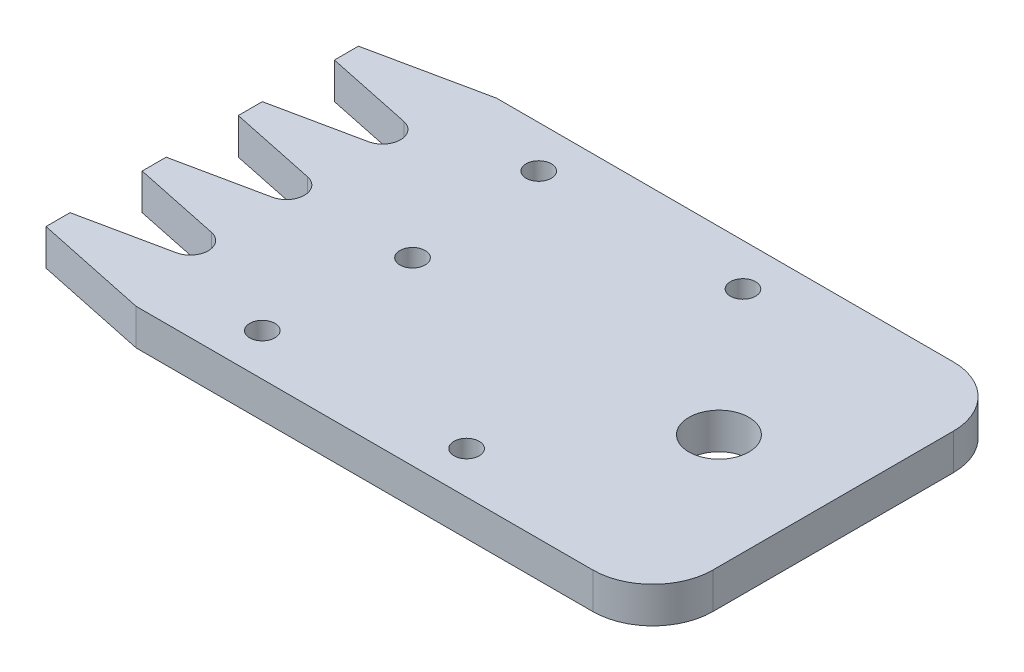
ISO-10303-21;
HEADER;
FILE_DESCRIPTION(('STEP AP214'),'2;1');
FILE_NAME('part.step','',(''),(''),'','','');
FILE_SCHEMA(('AUTOMOTIVE_DESIGN { 1 0 10303 214 1 1 1 1 }'));
ENDSEC;
DATA;
#1=APPLICATION_CONTEXT('core data for automotive mechanical design processes');
#2=APPLICATION_PROTOCOL_DEFINITION('international standard','automotive_design',2000,#1);
#3=PRODUCT_CONTEXT('',#1,'mechanical');
#4=PRODUCT('Part','Part','',(#3));
#5=PRODUCT_RELATED_PRODUCT_CATEGORY('part','',(#4));
#6=PRODUCT_DEFINITION_FORMATION('','',#4);
#7=PRODUCT_DEFINITION_CONTEXT('part definition',#1,'design');
#8=PRODUCT_DEFINITION('design','',#6,#7);
#9=PRODUCT_DEFINITION_SHAPE('','',#8);
#10=(LENGTH_UNIT() NAMED_UNIT(*) SI_UNIT(.MILLI.,.METRE.));
#11=(NAMED_UNIT(*) PLANE_ANGLE_UNIT() SI_UNIT($,.RADIAN.));
#12=(NAMED_UNIT(*) SI_UNIT($,.STERADIAN.) SOLID_ANGLE_UNIT());
#13=UNCERTAINTY_MEASURE_WITH_UNIT(LENGTH_MEASURE(1.E-05),#10,'distance_accuracy_value','');
#14=(GEOMETRIC_REPRESENTATION_CONTEXT(3) GLOBAL_UNCERTAINTY_ASSIGNED_CONTEXT((#13)) GLOBAL_UNIT_ASSIGNED_CONTEXT((#10,
#11,#12)) REPRESENTATION_CONTEXT('',''));
#15=CARTESIAN_POINT('',(0.,0.,0.));
#16=DIRECTION('',(0.,0.,1.));
#17=DIRECTION('',(1.,0.,0.));
#18=AXIS2_PLACEMENT_3D('',#15,#16,#17);
#19=CARTESIAN_POINT('',(14.,6.,-46.));
#20=DIRECTION('',(0.,1.,0.));
#21=DIRECTION('',(0.,0.,1.));
#22=AXIS2_PLACEMENT_3D('',#19,#20,#21);
#23=PLANE('',#22);
#24=CARTESIAN_POINT('',(33.,6.,-53.));
#25=DIRECTION('',(0.,1.,0.));
#26=DIRECTION('',(0.,0.,1.));
#27=AXIS2_PLACEMENT_3D('',#24,#25,#26);
#28=CIRCLE('',#27,2.1);
#29=CARTESIAN_POINT('',(33.,6.,-50.9));
#30=VERTEX_POINT('',#29);
#31=EDGE_CURVE('E395',#30,#30,#28,.T.);
#32=ORIENTED_EDGE('',*,*,#31,.F.);
#33=EDGE_LOOP('',(#32));
#34=FACE_BOUND('',#33,.T.);
#35=CARTESIAN_POINT('',(35.,6.,-30.));
#36=DIRECTION('',(0.,1.,0.));
#37=DIRECTION('',(0.,0.,1.));
#38=AXIS2_PLACEMENT_3D('',#35,#36,#37);
#39=CIRCLE('',#38,2.1);
#40=CARTESIAN_POINT('',(35.,6.,-27.9));
#41=VERTEX_POINT('',#40);
#42=EDGE_CURVE('E397',#41,#41,#39,.T.);
#43=ORIENTED_EDGE('',*,*,#42,.F.);
#44=EDGE_LOOP('',(#43));
#45=FACE_BOUND('',#44,.T.);
#46=CARTESIAN_POINT('',(33.,6.,-7.));
#47=DIRECTION('',(0.,1.,0.));
#48=DIRECTION('',(0.,0.,1.));
#49=AXIS2_PLACEMENT_3D('',#46,#47,#48);
#50=CIRCLE('',#49,2.1);
#51=CARTESIAN_POINT('',(33.,6.,-4.9));
#52=VERTEX_POINT('',#51);
#53=EDGE_CURVE('E405',#52,#52,#50,.T.);
#54=ORIENTED_EDGE('',*,*,#53,.F.);
#55=EDGE_LOOP('',(#54));
#56=FACE_BOUND('',#55,.T.);
#57=CARTESIAN_POINT('',(67.,6.,-7.));
#58=DIRECTION('',(0.,1.,0.));
#59=DIRECTION('',(0.,0.,1.));
#60=AXIS2_PLACEMENT_3D('',#57,#58,#59);
#61=CIRCLE('',#60,2.1);
#62=CARTESIAN_POINT('',(67.,6.,-4.9));
#63=VERTEX_POINT('',#62);
#64=EDGE_CURVE('E411',#63,#63,#61,.T.);
#65=ORIENTED_EDGE('',*,*,#64,.F.);
#66=EDGE_LOOP('',(#65));
#67=FACE_BOUND('',#66,.T.);
#68=CARTESIAN_POINT('',(67.,6.,-53.));
#69=DIRECTION('',(0.,1.,0.));
#70=DIRECTION('',(0.,0.,1.));
#71=AXIS2_PLACEMENT_3D('',#68,#69,#70);
#72=CIRCLE('',#71,2.1);
#73=CARTESIAN_POINT('',(67.,6.,-50.9));
#74=VERTEX_POINT('',#73);
#75=EDGE_CURVE('E417',#74,#74,#72,.T.);
#76=ORIENTED_EDGE('',*,*,#75,.F.);
#77=EDGE_LOOP('',(#76));
#78=FACE_BOUND('',#77,.T.);
#79=CARTESIAN_POINT('',(14.,6.,-46.));
#80=DIRECTION('',(0.,-1.,0.));
#81=DIRECTION('',(0.,0.,1.));
#82=AXIS2_PLACEMENT_3D('',#79,#80,#81);
#83=CIRCLE('',#82,3.);
#84=CARTESIAN_POINT('',(14.6155056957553,6.,-48.9361799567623));
#85=VERTEX_POINT('',#84);
#86=CARTESIAN_POINT('',(14.6155056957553,6.,-43.0638200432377));
#87=VERTEX_POINT('',#86);
#88=EDGE_CURVE('E239',#85,#87,#83,.T.);
#89=ORIENTED_EDGE('',*,*,#88,.T.);
#90=DIRECTION('',(-0.978726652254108,0.,0.205168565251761));
#91=VECTOR('',#90,1.);
#92=CARTESIAN_POINT('',(0.,6.,-40.));
#93=LINE('',#92,#91);
#94=CARTESIAN_POINT('',(0.,6.,-40.));
#95=VERTEX_POINT('',#94);
#96=EDGE_CURVE('E127',#87,#95,#93,.T.);
#97=ORIENTED_EDGE('',*,*,#96,.T.);
#98=DIRECTION('',(0.,0.,1.));
#99=VECTOR('',#98,1.);
#100=CARTESIAN_POINT('',(0.,6.,-36.));
#101=LINE('',#100,#99);
#102=CARTESIAN_POINT('',(0.,6.,-36.));
#103=VERTEX_POINT('',#102);
#104=EDGE_CURVE('E290',#95,#103,#101,.T.);
#105=ORIENTED_EDGE('',*,*,#104,.T.);
#106=DIRECTION('',(0.978726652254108,0.,0.20516856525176));
#107=VECTOR('',#106,1.);
#108=CARTESIAN_POINT('',(0.,6.,-36.));
#109=LINE('',#108,#107);
#110=CARTESIAN_POINT('',(14.6155056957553,6.,-32.9361799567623));
#111=VERTEX_POINT('',#110);
#112=EDGE_CURVE('E309',#103,#111,#109,.T.);
#113=ORIENTED_EDGE('',*,*,#112,.T.);
#114=CARTESIAN_POINT('',(14.,6.,-30.));
#115=DIRECTION('',(0.,-1.,0.));
#116=DIRECTION('',(0.,0.,1.));
#117=AXIS2_PLACEMENT_3D('',#114,#115,#116);
#118=CIRCLE('',#117,3.00000000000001);
#119=CARTESIAN_POINT('',(14.6155056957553,6.,-27.0638200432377));
#120=VERTEX_POINT('',#119);
#121=EDGE_CURVE('E306',#111,#120,#118,.T.);
#122=ORIENTED_EDGE('',*,*,#121,.T.);
#123=DIRECTION('',(-0.978726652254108,0.,0.20516856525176));
#124=VECTOR('',#123,1.);
#125=CARTESIAN_POINT('',(0.,6.,-24.));
#126=LINE('',#125,#124);
#127=CARTESIAN_POINT('',(0.,6.,-24.));
#128=VERTEX_POINT('',#127);
#129=EDGE_CURVE('E308',#120,#128,#126,.T.);
#130=ORIENTED_EDGE('',*,*,#129,.T.);
#131=DIRECTION('',(0.,0.,1.));
#132=VECTOR('',#131,1.);
#133=CARTESIAN_POINT('',(0.,6.,-20.));
#134=LINE('',#133,#132);
#135=CARTESIAN_POINT('',(0.,6.,-20.));
#136=VERTEX_POINT('',#135);
#137=EDGE_CURVE('E311',#128,#136,#134,.T.);
#138=ORIENTED_EDGE('',*,*,#137,.T.);
#139=DIRECTION('',(0.978726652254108,0.,0.20516856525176));
#140=VECTOR('',#139,1.);
#141=CARTESIAN_POINT('',(0.,6.,-20.));
#142=LINE('',#141,#140);
#143=CARTESIAN_POINT('',(14.6155056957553,6.,-16.9361799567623));
#144=VERTEX_POINT('',#143);
#145=EDGE_CURVE('E317',#136,#144,#142,.T.);
#146=ORIENTED_EDGE('',*,*,#145,.T.);
#147=CARTESIAN_POINT('',(14.,6.,-14.));
#148=DIRECTION('',(0.,-1.,0.));
#149=DIRECTION('',(0.,0.,1.));
#150=AXIS2_PLACEMENT_3D('',#147,#148,#149);
#151=CIRCLE('',#150,3.);
#152=CARTESIAN_POINT('',(14.6155056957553,6.,-11.0638200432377));
#153=VERTEX_POINT('',#152);
#154=EDGE_CURVE('E319',#144,#153,#151,.T.);
#155=ORIENTED_EDGE('',*,*,#154,.T.);
#156=DIRECTION('',(-0.978726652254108,0.,0.205168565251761));
#157=VECTOR('',#156,1.);
#158=CARTESIAN_POINT('',(0.,6.,-8.));
#159=LINE('',#158,#157);
#160=CARTESIAN_POINT('',(0.,6.,-8.));
#161=VERTEX_POINT('',#160);
#162=EDGE_CURVE('E321',#153,#161,#159,.T.);
#163=ORIENTED_EDGE('',*,*,#162,.T.);
#164=DIRECTION('',(0.,0.,1.));
#165=VECTOR('',#164,1.);
#166=CARTESIAN_POINT('',(0.,6.,-4.));
#167=LINE('',#166,#165);
#168=CARTESIAN_POINT('',(0.,6.,-4.));
#169=VERTEX_POINT('',#168);
#170=EDGE_CURVE('E323',#161,#169,#167,.T.);
#171=ORIENTED_EDGE('',*,*,#170,.T.);
#172=DIRECTION('',(0.978549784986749,0.,0.206010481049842));
#173=VECTOR('',#172,1.);
#174=CARTESIAN_POINT('',(19.,6.,0.));
#175=LINE('',#174,#173);
#176=CARTESIAN_POINT('',(19.,6.,0.));
#177=VERTEX_POINT('',#176);
#178=EDGE_CURVE('E325',#169,#177,#175,.T.);
#179=ORIENTED_EDGE('',*,*,#178,.T.);
#180=DIRECTION('',(1.,0.,0.));
#181=VECTOR('',#180,1.);
#182=CARTESIAN_POINT('',(19.,6.,0.));
#183=LINE('',#182,#181);
#184=CARTESIAN_POINT('',(94.9999999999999,6.,0.));
#185=VERTEX_POINT('',#184);
#186=EDGE_CURVE('E327',#177,#185,#183,.T.);
#187=ORIENTED_EDGE('',*,*,#186,.T.);
#188=CARTESIAN_POINT('',(95.,6.,-10.));
#189=DIRECTION('',(0.,1.,0.));
#190=DIRECTION('',(0.,0.,1.));
#191=AXIS2_PLACEMENT_3D('',#188,#189,#190);
#192=CIRCLE('',#191,10.);
#193=CARTESIAN_POINT('',(105.,6.,-10.0000000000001));
#194=VERTEX_POINT('',#193);
#195=EDGE_CURVE('E329',#185,#194,#192,.T.);
#196=ORIENTED_EDGE('',*,*,#195,.T.);
#197=DIRECTION('',(0.,0.,-1.));
#198=VECTOR('',#197,1.);
#199=CARTESIAN_POINT('',(105.,6.,-10.0000000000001));
#200=LINE('',#199,#198);
#201=CARTESIAN_POINT('',(105.,6.,-49.9999999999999));
#202=VERTEX_POINT('',#201);
#203=EDGE_CURVE('E331',#194,#202,#200,.T.);
#204=ORIENTED_EDGE('',*,*,#203,.T.);
#205=CARTESIAN_POINT('',(95.,6.,-50.));
#206=DIRECTION('',(0.,1.,0.));
#207=DIRECTION('',(0.,0.,1.));
#208=AXIS2_PLACEMENT_3D('',#205,#206,#207);
#209=CIRCLE('',#208,9.99999999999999);
#210=CARTESIAN_POINT('',(94.9999999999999,6.,-60.));
#211=VERTEX_POINT('',#210);
#212=EDGE_CURVE('E333',#202,#211,#209,.T.);
#213=ORIENTED_EDGE('',*,*,#212,.T.);
#214=DIRECTION('',(-1.,0.,0.));
#215=VECTOR('',#214,1.);
#216=CARTESIAN_POINT('',(19.,6.,-60.));
#217=LINE('',#216,#215);
#218=CARTESIAN_POINT('',(19.,6.,-60.));
#219=VERTEX_POINT('',#218);
#220=EDGE_CURVE('E182',#211,#219,#217,.T.);
#221=ORIENTED_EDGE('',*,*,#220,.T.);
#222=DIRECTION('',(-0.978549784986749,0.,0.206010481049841));
#223=VECTOR('',#222,1.);
#224=CARTESIAN_POINT('',(19.,6.,-60.));
#225=LINE('',#224,#223);
#226=CARTESIAN_POINT('',(0.,6.,-56.));
#227=VERTEX_POINT('',#226);
#228=EDGE_CURVE('E176',#219,#227,#225,.T.);
#229=ORIENTED_EDGE('',*,*,#228,.T.);
#230=DIRECTION('',(0.,0.,1.));
#231=VECTOR('',#230,1.);
#232=CARTESIAN_POINT('',(0.,6.,-52.));
#233=LINE('',#232,#231);
#234=CARTESIAN_POINT('',(0.,6.,-52.));
#235=VERTEX_POINT('',#234);
#236=EDGE_CURVE('E180',#227,#235,#233,.T.);
#237=ORIENTED_EDGE('',*,*,#236,.T.);
#238=DIRECTION('',(0.978726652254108,0.,0.205168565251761));
#239=VECTOR('',#238,1.);
#240=CARTESIAN_POINT('',(0.,6.,-52.));
#241=LINE('',#240,#239);
#242=EDGE_CURVE('E48',#235,#85,#241,.T.);
#243=ORIENTED_EDGE('',*,*,#242,.T.);
#244=EDGE_LOOP('',(#89,#97,#105,#113,#122,#130,#138,#146,#155,#163,#171,#179,#187,#196,#204,
#213,#221,#229,#237,#243));
#245=FACE_BOUND('',#244,.T.);
#246=CARTESIAN_POINT('',(86.,6.,-30.));
#247=DIRECTION('',(0.,1.,0.));
#248=DIRECTION('',(0.,0.,1.));
#249=AXIS2_PLACEMENT_3D('',#246,#247,#248);
#250=CIRCLE('',#249,5.);
#251=CARTESIAN_POINT('',(86.,6.,-25.));
#252=VERTEX_POINT('',#251);
#253=EDGE_CURVE('E204',#252,#252,#250,.T.);
#254=ORIENTED_EDGE('',*,*,#253,.F.);
#255=EDGE_LOOP('',(#254));
#256=FACE_BOUND('',#255,.T.);
#257=ADVANCED_FACE('F31',(#34,#45,#56,#67,#78,#245,#256),#23,.T.);
#258=CARTESIAN_POINT('',(14.,0.,-46.));
#259=DIRECTION('',(0.,1.,0.));
#260=DIRECTION('',(0.,0.,1.));
#261=AXIS2_PLACEMENT_3D('',#258,#259,#260);
#262=PLANE('',#261);
#263=CARTESIAN_POINT('',(33.,0.,-53.));
#264=DIRECTION('',(0.,1.,0.));
#265=DIRECTION('',(0.,0.,1.));
#266=AXIS2_PLACEMENT_3D('',#263,#264,#265);
#267=CIRCLE('',#266,2.1);
#268=CARTESIAN_POINT('',(33.,0.,-50.9));
#269=VERTEX_POINT('',#268);
#270=EDGE_CURVE('E393',#269,#269,#267,.T.);
#271=ORIENTED_EDGE('',*,*,#270,.T.);
#272=EDGE_LOOP('',(#271));
#273=FACE_BOUND('',#272,.T.);
#274=CARTESIAN_POINT('',(35.,0.,-30.));
#275=DIRECTION('',(0.,1.,0.));
#276=DIRECTION('',(0.,0.,1.));
#277=AXIS2_PLACEMENT_3D('',#274,#275,#276);
#278=CIRCLE('',#277,2.1);
#279=CARTESIAN_POINT('',(35.,0.,-27.9));
#280=VERTEX_POINT('',#279);
#281=EDGE_CURVE('E402',#280,#280,#278,.T.);
#282=ORIENTED_EDGE('',*,*,#281,.T.);
#283=EDGE_LOOP('',(#282));
#284=FACE_BOUND('',#283,.T.);
#285=CARTESIAN_POINT('',(33.,0.,-7.));
#286=DIRECTION('',(0.,1.,0.));
#287=DIRECTION('',(0.,0.,1.));
#288=AXIS2_PLACEMENT_3D('',#285,#286,#287);
#289=CIRCLE('',#288,2.1);
#290=CARTESIAN_POINT('',(33.,0.,-4.9));
#291=VERTEX_POINT('',#290);
#292=EDGE_CURVE('E408',#291,#291,#289,.T.);
#293=ORIENTED_EDGE('',*,*,#292,.T.);
#294=EDGE_LOOP('',(#293));
#295=FACE_BOUND('',#294,.T.);
#296=CARTESIAN_POINT('',(67.,0.,-7.));
#297=DIRECTION('',(0.,1.,0.));
#298=DIRECTION('',(0.,0.,1.));
#299=AXIS2_PLACEMENT_3D('',#296,#297,#298);
#300=CIRCLE('',#299,2.1);
#301=CARTESIAN_POINT('',(67.,0.,-4.9));
#302=VERTEX_POINT('',#301);
#303=EDGE_CURVE('E414',#302,#302,#300,.T.);
#304=ORIENTED_EDGE('',*,*,#303,.T.);
#305=EDGE_LOOP('',(#304));
#306=FACE_BOUND('',#305,.T.);
#307=CARTESIAN_POINT('',(67.,0.,-53.));
#308=DIRECTION('',(0.,1.,0.));
#309=DIRECTION('',(0.,0.,1.));
#310=AXIS2_PLACEMENT_3D('',#307,#308,#309);
#311=CIRCLE('',#310,2.1);
#312=CARTESIAN_POINT('',(67.,0.,-50.9));
#313=VERTEX_POINT('',#312);
#314=EDGE_CURVE('E420',#313,#313,#311,.T.);
#315=ORIENTED_EDGE('',*,*,#314,.T.);
#316=EDGE_LOOP('',(#315));
#317=FACE_BOUND('',#316,.T.);
#318=CARTESIAN_POINT('',(14.,0.,-46.));
#319=DIRECTION('',(0.,-1.,0.));
#320=DIRECTION('',(0.,0.,1.));
#321=AXIS2_PLACEMENT_3D('',#318,#319,#320);
#322=CIRCLE('',#321,3.);
#323=CARTESIAN_POINT('',(14.6155056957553,0.,-48.9361799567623));
#324=VERTEX_POINT('',#323);
#325=CARTESIAN_POINT('',(14.6155056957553,0.,-43.0638200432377));
#326=VERTEX_POINT('',#325);
#327=EDGE_CURVE('E200',#324,#326,#322,.T.);
#328=ORIENTED_EDGE('',*,*,#327,.F.);
#329=DIRECTION('',(0.978726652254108,0.,0.205168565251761));
#330=VECTOR('',#329,1.);
#331=CARTESIAN_POINT('',(0.,0.,-52.));
#332=LINE('',#331,#330);
#333=CARTESIAN_POINT('',(0.,0.,-52.));
#334=VERTEX_POINT('',#333);
#335=EDGE_CURVE('E119',#334,#324,#332,.T.);
#336=ORIENTED_EDGE('',*,*,#335,.F.);
#337=DIRECTION('',(0.,0.,1.));
#338=VECTOR('',#337,1.);
#339=CARTESIAN_POINT('',(0.,0.,-52.));
#340=LINE('',#339,#338);
#341=CARTESIAN_POINT('',(0.,0.,-56.));
#342=VERTEX_POINT('',#341);
#343=EDGE_CURVE('E113',#342,#334,#340,.T.);
#344=ORIENTED_EDGE('',*,*,#343,.F.);
#345=DIRECTION('',(-0.978549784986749,0.,0.206010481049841));
#346=VECTOR('',#345,1.);
#347=CARTESIAN_POINT('',(19.,0.,-60.));
#348=LINE('',#347,#346);
#349=CARTESIAN_POINT('',(19.,0.,-60.));
#350=VERTEX_POINT('',#349);
#351=EDGE_CURVE('E190',#350,#342,#348,.T.);
#352=ORIENTED_EDGE('',*,*,#351,.F.);
#353=DIRECTION('',(-1.,0.,0.));
#354=VECTOR('',#353,1.);
#355=CARTESIAN_POINT('',(19.,0.,-60.));
#356=LINE('',#355,#354);
#357=CARTESIAN_POINT('',(94.9999999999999,0.,-60.));
#358=VERTEX_POINT('',#357);
#359=EDGE_CURVE('E234',#358,#350,#356,.T.);
#360=ORIENTED_EDGE('',*,*,#359,.F.);
#361=CARTESIAN_POINT('',(95.,0.,-50.));
#362=DIRECTION('',(0.,1.,0.));
#363=DIRECTION('',(0.,0.,1.));
#364=AXIS2_PLACEMENT_3D('',#361,#362,#363);
#365=CIRCLE('',#364,9.99999999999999);
#366=CARTESIAN_POINT('',(105.,0.,-49.9999999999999));
#367=VERTEX_POINT('',#366);
#368=EDGE_CURVE('E232',#367,#358,#365,.T.);
#369=ORIENTED_EDGE('',*,*,#368,.F.);
#370=DIRECTION('',(0.,0.,-1.));
#371=VECTOR('',#370,1.);
#372=CARTESIAN_POINT('',(105.,0.,-10.0000000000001));
#373=LINE('',#372,#371);
#374=CARTESIAN_POINT('',(105.,0.,-10.0000000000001));
#375=VERTEX_POINT('',#374);
#376=EDGE_CURVE('E230',#375,#367,#373,.T.);
#377=ORIENTED_EDGE('',*,*,#376,.F.);
#378=CARTESIAN_POINT('',(95.,0.,-10.));
#379=DIRECTION('',(0.,1.,0.));
#380=DIRECTION('',(0.,0.,1.));
#381=AXIS2_PLACEMENT_3D('',#378,#379,#380);
#382=CIRCLE('',#381,10.);
#383=CARTESIAN_POINT('',(94.9999999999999,0.,0.));
#384=VERTEX_POINT('',#383);
#385=EDGE_CURVE('E228',#384,#375,#382,.T.);
#386=ORIENTED_EDGE('',*,*,#385,.F.);
#387=DIRECTION('',(1.,0.,0.));
#388=VECTOR('',#387,1.);
#389=CARTESIAN_POINT('',(19.,0.,0.));
#390=LINE('',#389,#388);
#391=CARTESIAN_POINT('',(19.,0.,0.));
#392=VERTEX_POINT('',#391);
#393=EDGE_CURVE('E226',#392,#384,#390,.T.);
#394=ORIENTED_EDGE('',*,*,#393,.F.);
#395=DIRECTION('',(0.978549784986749,0.,0.206010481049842));
#396=VECTOR('',#395,1.);
#397=CARTESIAN_POINT('',(19.,0.,0.));
#398=LINE('',#397,#396);
#399=CARTESIAN_POINT('',(0.,0.,-4.));
#400=VERTEX_POINT('',#399);
#401=EDGE_CURVE('E224',#400,#392,#398,.T.);
#402=ORIENTED_EDGE('',*,*,#401,.F.);
#403=DIRECTION('',(0.,0.,1.));
#404=VECTOR('',#403,1.);
#405=CARTESIAN_POINT('',(0.,0.,-4.));
#406=LINE('',#405,#404);
#407=CARTESIAN_POINT('',(0.,0.,-8.));
#408=VERTEX_POINT('',#407);
#409=EDGE_CURVE('E222',#408,#400,#406,.T.);
#410=ORIENTED_EDGE('',*,*,#409,.F.);
#411=DIRECTION('',(-0.978726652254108,0.,0.205168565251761));
#412=VECTOR('',#411,1.);
#413=CARTESIAN_POINT('',(0.,0.,-8.));
#414=LINE('',#413,#412);
#415=CARTESIAN_POINT('',(14.6155056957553,0.,-11.0638200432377));
#416=VERTEX_POINT('',#415);
#417=EDGE_CURVE('E220',#416,#408,#414,.T.);
#418=ORIENTED_EDGE('',*,*,#417,.F.);
#419=CARTESIAN_POINT('',(14.,0.,-14.));
#420=DIRECTION('',(0.,-1.,0.));
#421=DIRECTION('',(0.,0.,1.));
#422=AXIS2_PLACEMENT_3D('',#419,#420,#421);
#423=CIRCLE('',#422,3.);
#424=CARTESIAN_POINT('',(14.6155056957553,0.,-16.9361799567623));
#425=VERTEX_POINT('',#424);
#426=EDGE_CURVE('E218',#425,#416,#423,.T.);
#427=ORIENTED_EDGE('',*,*,#426,.F.);
#428=DIRECTION('',(0.978726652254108,0.,0.20516856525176));
#429=VECTOR('',#428,1.);
#430=CARTESIAN_POINT('',(0.,0.,-20.));
#431=LINE('',#430,#429);
#432=CARTESIAN_POINT('',(0.,0.,-20.));
#433=VERTEX_POINT('',#432);
#434=EDGE_CURVE('E216',#433,#425,#431,.T.);
#435=ORIENTED_EDGE('',*,*,#434,.F.);
#436=DIRECTION('',(0.,0.,1.));
#437=VECTOR('',#436,1.);
#438=CARTESIAN_POINT('',(0.,0.,-20.));
#439=LINE('',#438,#437);
#440=CARTESIAN_POINT('',(0.,0.,-24.));
#441=VERTEX_POINT('',#440);
#442=EDGE_CURVE('E214',#441,#433,#439,.T.);
#443=ORIENTED_EDGE('',*,*,#442,.F.);
#444=DIRECTION('',(-0.978726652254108,0.,0.20516856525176));
#445=VECTOR('',#444,1.);
#446=CARTESIAN_POINT('',(0.,0.,-24.));
#447=LINE('',#446,#445);
#448=CARTESIAN_POINT('',(14.6155056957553,0.,-27.0638200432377));
#449=VERTEX_POINT('',#448);
#450=EDGE_CURVE('E212',#449,#441,#447,.T.);
#451=ORIENTED_EDGE('',*,*,#450,.F.);
#452=CARTESIAN_POINT('',(14.,0.,-30.));
#453=DIRECTION('',(0.,-1.,0.));
#454=DIRECTION('',(0.,0.,1.));
#455=AXIS2_PLACEMENT_3D('',#452,#453,#454);
#456=CIRCLE('',#455,3.00000000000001);
#457=CARTESIAN_POINT('',(14.6155056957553,0.,-32.9361799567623));
#458=VERTEX_POINT('',#457);
#459=EDGE_CURVE('E210',#458,#449,#456,.T.);
#460=ORIENTED_EDGE('',*,*,#459,.F.);
#461=DIRECTION('',(0.978726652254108,0.,0.20516856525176));
#462=VECTOR('',#461,1.);
#463=CARTESIAN_POINT('',(0.,0.,-36.));
#464=LINE('',#463,#462);
#465=CARTESIAN_POINT('',(0.,0.,-36.));
#466=VERTEX_POINT('',#465);
#467=EDGE_CURVE('E208',#466,#458,#464,.T.);
#468=ORIENTED_EDGE('',*,*,#467,.F.);
#469=DIRECTION('',(0.,0.,1.));
#470=VECTOR('',#469,1.);
#471=CARTESIAN_POINT('',(0.,0.,-36.));
#472=LINE('',#471,#470);
#473=CARTESIAN_POINT('',(0.,0.,-40.));
#474=VERTEX_POINT('',#473);
#475=EDGE_CURVE('E206',#474,#466,#472,.T.);
#476=ORIENTED_EDGE('',*,*,#475,.F.);
#477=DIRECTION('',(-0.978726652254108,0.,0.205168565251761));
#478=VECTOR('',#477,1.);
#479=CARTESIAN_POINT('',(0.,0.,-40.));
#480=LINE('',#479,#478);
#481=EDGE_CURVE('E203',#326,#474,#480,.T.);
#482=ORIENTED_EDGE('',*,*,#481,.F.);
#483=EDGE_LOOP('',(#328,#336,#344,#352,#360,#369,#377,#386,#394,#402,#410,#418,#427,#435,#443,
#451,#460,#468,#476,#482));
#484=FACE_BOUND('',#483,.T.);
#485=CARTESIAN_POINT('',(86.,0.,-30.));
#486=DIRECTION('',(0.,1.,0.));
#487=DIRECTION('',(0.,0.,1.));
#488=AXIS2_PLACEMENT_3D('',#485,#486,#487);
#489=CIRCLE('',#488,5.);
#490=CARTESIAN_POINT('',(86.,0.,-25.));
#491=VERTEX_POINT('',#490);
#492=EDGE_CURVE('E423',#491,#491,#489,.T.);
#493=ORIENTED_EDGE('',*,*,#492,.T.);
#494=EDGE_LOOP('',(#493));
#495=FACE_BOUND('',#494,.T.);
#496=ADVANCED_FACE('F294',(#273,#284,#295,#306,#317,#484,#495),#262,.F.);
#497=CARTESIAN_POINT('',(14.,6.,-46.));
#498=DIRECTION('',(0.,-1.,0.));
#499=DIRECTION('',(0.,0.,-1.));
#500=AXIS2_PLACEMENT_3D('',#497,#498,#499);
#501=CYLINDRICAL_SURFACE('',#500,3.);
#502=ORIENTED_EDGE('',*,*,#327,.T.);
#503=DIRECTION('',(0.,-1.,0.));
#504=VECTOR('',#503,1.);
#505=CARTESIAN_POINT('',(14.6155056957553,6.,-43.0638200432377));
#506=LINE('',#505,#504);
#507=EDGE_CURVE('E11',#87,#326,#506,.T.);
#508=ORIENTED_EDGE('',*,*,#507,.F.);
#509=ORIENTED_EDGE('',*,*,#88,.F.);
#510=DIRECTION('',(0.,-1.,0.));
#511=VECTOR('',#510,1.);
#512=CARTESIAN_POINT('',(14.6155056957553,6.,-48.9361799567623));
#513=LINE('',#512,#511);
#514=EDGE_CURVE('E196',#85,#324,#513,.T.);
#515=ORIENTED_EDGE('',*,*,#514,.T.);
#516=EDGE_LOOP('',(#502,#508,#509,#515));
#517=FACE_BOUND('',#516,.T.);
#518=ADVANCED_FACE('F33',(#517),#501,.F.);
#519=CARTESIAN_POINT('',(0.,6.,-40.));
#520=DIRECTION('',(0.205168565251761,0.,0.978726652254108));
#521=DIRECTION('',(0.978726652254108,0.,-0.205168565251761));
#522=AXIS2_PLACEMENT_3D('',#519,#520,#521);
#523=PLANE('',#522);
#524=ORIENTED_EDGE('',*,*,#481,.T.);
#525=DIRECTION('',(0.,-1.,0.));
#526=VECTOR('',#525,1.);
#527=CARTESIAN_POINT('',(0.,6.,-40.));
#528=LINE('',#527,#526);
#529=EDGE_CURVE('E40',#95,#474,#528,.T.);
#530=ORIENTED_EDGE('',*,*,#529,.F.);
#531=ORIENTED_EDGE('',*,*,#96,.F.);
#532=ORIENTED_EDGE('',*,*,#507,.T.);
#533=EDGE_LOOP('',(#524,#530,#531,#532));
#534=FACE_BOUND('',#533,.T.);
#535=ADVANCED_FACE('F493',(#534),#523,.F.);
#536=CARTESIAN_POINT('',(0.,6.,-36.));
#537=DIRECTION('',(1.,0.,0.));
#538=DIRECTION('',(0.,0.,-1.));
#539=AXIS2_PLACEMENT_3D('',#536,#537,#538);
#540=PLANE('',#539);
#541=ORIENTED_EDGE('',*,*,#475,.T.);
#542=DIRECTION('',(0.,-1.,0.));
#543=VECTOR('',#542,1.);
#544=CARTESIAN_POINT('',(0.,6.,-36.));
#545=LINE('',#544,#543);
#546=EDGE_CURVE('E282',#103,#466,#545,.T.);
#547=ORIENTED_EDGE('',*,*,#546,.F.);
#548=ORIENTED_EDGE('',*,*,#104,.F.);
#549=ORIENTED_EDGE('',*,*,#529,.T.);
#550=EDGE_LOOP('',(#541,#547,#548,#549));
#551=FACE_BOUND('',#550,.T.);
#552=ADVANCED_FACE('F288',(#551),#540,.F.);
#553=CARTESIAN_POINT('',(0.,6.,-36.));
#554=DIRECTION('',(0.20516856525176,0.,-0.978726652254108));
#555=DIRECTION('',(-0.978726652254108,0.,-0.20516856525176));
#556=AXIS2_PLACEMENT_3D('',#553,#554,#555);
#557=PLANE('',#556);
#558=ORIENTED_EDGE('',*,*,#467,.T.);
#559=DIRECTION('',(0.,-1.,0.));
#560=VECTOR('',#559,1.);
#561=CARTESIAN_POINT('',(14.6155056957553,6.,-32.9361799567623));
#562=LINE('',#561,#560);
#563=EDGE_CURVE('E279',#111,#458,#562,.T.);
#564=ORIENTED_EDGE('',*,*,#563,.F.);
#565=ORIENTED_EDGE('',*,*,#112,.F.);
#566=ORIENTED_EDGE('',*,*,#546,.T.);
#567=EDGE_LOOP('',(#558,#564,#565,#566));
#568=FACE_BOUND('',#567,.T.);
#569=ADVANCED_FACE('F300',(#568),#557,.F.);
#570=CARTESIAN_POINT('',(14.,6.,-30.));
#571=DIRECTION('',(0.,-1.,0.));
#572=DIRECTION('',(0.,0.,-1.));
#573=AXIS2_PLACEMENT_3D('',#570,#571,#572);
#574=CYLINDRICAL_SURFACE('',#573,3.00000000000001);
#575=ORIENTED_EDGE('',*,*,#459,.T.);
#576=DIRECTION('',(0.,-1.,0.));
#577=VECTOR('',#576,1.);
#578=CARTESIAN_POINT('',(14.6155056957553,6.,-27.0638200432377));
#579=LINE('',#578,#577);
#580=EDGE_CURVE('E276',#120,#449,#579,.T.);
#581=ORIENTED_EDGE('',*,*,#580,.F.);
#582=ORIENTED_EDGE('',*,*,#121,.F.);
#583=ORIENTED_EDGE('',*,*,#563,.T.);
#584=EDGE_LOOP('',(#575,#581,#582,#583));
#585=FACE_BOUND('',#584,.T.);
#586=ADVANCED_FACE('F304',(#585),#574,.F.);
#587=CARTESIAN_POINT('',(0.,6.,-24.));
#588=DIRECTION('',(0.20516856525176,0.,0.978726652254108));
#589=DIRECTION('',(0.978726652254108,0.,-0.20516856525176));
#590=AXIS2_PLACEMENT_3D('',#587,#588,#589);
#591=PLANE('',#590);
#592=ORIENTED_EDGE('',*,*,#450,.T.);
#593=DIRECTION('',(0.,-1.,0.));
#594=VECTOR('',#593,1.);
#595=CARTESIAN_POINT('',(0.,6.,-24.));
#596=LINE('',#595,#594);
#597=EDGE_CURVE('E273',#128,#441,#596,.T.);
#598=ORIENTED_EDGE('',*,*,#597,.F.);
#599=ORIENTED_EDGE('',*,*,#129,.F.);
#600=ORIENTED_EDGE('',*,*,#580,.T.);
#601=EDGE_LOOP('',(#592,#598,#599,#600));
#602=FACE_BOUND('',#601,.T.);
#603=ADVANCED_FACE('F515',(#602),#591,.F.);
#604=CARTESIAN_POINT('',(0.,6.,-20.));
#605=DIRECTION('',(1.,0.,0.));
#606=DIRECTION('',(0.,0.,-1.));
#607=AXIS2_PLACEMENT_3D('',#604,#605,#606);
#608=PLANE('',#607);
#609=ORIENTED_EDGE('',*,*,#442,.T.);
#610=DIRECTION('',(0.,-1.,0.));
#611=VECTOR('',#610,1.);
#612=CARTESIAN_POINT('',(0.,6.,-20.));
#613=LINE('',#612,#611);
#614=EDGE_CURVE('E270',#136,#433,#613,.T.);
#615=ORIENTED_EDGE('',*,*,#614,.F.);
#616=ORIENTED_EDGE('',*,*,#137,.F.);
#617=ORIENTED_EDGE('',*,*,#597,.T.);
#618=EDGE_LOOP('',(#609,#615,#616,#617));
#619=FACE_BOUND('',#618,.T.);
#620=ADVANCED_FACE('F522',(#619),#608,.F.);
#621=CARTESIAN_POINT('',(0.,6.,-20.));
#622=DIRECTION('',(0.20516856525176,0.,-0.978726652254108));
#623=DIRECTION('',(-0.978726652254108,0.,-0.20516856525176));
#624=AXIS2_PLACEMENT_3D('',#621,#622,#623);
#625=PLANE('',#624);
#626=ORIENTED_EDGE('',*,*,#434,.T.);
#627=DIRECTION('',(0.,-1.,0.));
#628=VECTOR('',#627,1.);
#629=CARTESIAN_POINT('',(14.6155056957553,6.,-16.9361799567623));
#630=LINE('',#629,#628);
#631=EDGE_CURVE('E267',#144,#425,#630,.T.);
#632=ORIENTED_EDGE('',*,*,#631,.F.);
#633=ORIENTED_EDGE('',*,*,#145,.F.);
#634=ORIENTED_EDGE('',*,*,#614,.T.);
#635=EDGE_LOOP('',(#626,#632,#633,#634));
#636=FACE_BOUND('',#635,.T.);
#637=ADVANCED_FACE('F530',(#636),#625,.F.);
#638=CARTESIAN_POINT('',(14.,6.,-14.));
#639=DIRECTION('',(0.,-1.,0.));
#640=DIRECTION('',(0.,0.,-1.));
#641=AXIS2_PLACEMENT_3D('',#638,#639,#640);
#642=CYLINDRICAL_SURFACE('',#641,3.);
#643=ORIENTED_EDGE('',*,*,#426,.T.);
#644=DIRECTION('',(0.,-1.,0.));
#645=VECTOR('',#644,1.);
#646=CARTESIAN_POINT('',(14.6155056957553,6.,-11.0638200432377));
#647=LINE('',#646,#645);
#648=EDGE_CURVE('E264',#153,#416,#647,.T.);
#649=ORIENTED_EDGE('',*,*,#648,.F.);
#650=ORIENTED_EDGE('',*,*,#154,.F.);
#651=ORIENTED_EDGE('',*,*,#631,.T.);
#652=EDGE_LOOP('',(#643,#649,#650,#651));
#653=FACE_BOUND('',#652,.T.);
#654=ADVANCED_FACE('F538',(#653),#642,.F.);
#655=CARTESIAN_POINT('',(0.,6.,-8.));
#656=DIRECTION('',(0.205168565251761,0.,0.978726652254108));
#657=DIRECTION('',(0.978726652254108,0.,-0.205168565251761));
#658=AXIS2_PLACEMENT_3D('',#655,#656,#657);
#659=PLANE('',#658);
#660=ORIENTED_EDGE('',*,*,#417,.T.);
#661=DIRECTION('',(0.,-1.,0.));
#662=VECTOR('',#661,1.);
#663=CARTESIAN_POINT('',(0.,6.,-8.));
#664=LINE('',#663,#662);
#665=EDGE_CURVE('E261',#161,#408,#664,.T.);
#666=ORIENTED_EDGE('',*,*,#665,.F.);
#667=ORIENTED_EDGE('',*,*,#162,.F.);
#668=ORIENTED_EDGE('',*,*,#648,.T.);
#669=EDGE_LOOP('',(#660,#666,#667,#668));
#670=FACE_BOUND('',#669,.T.);
#671=ADVANCED_FACE('F546',(#670),#659,.F.);
#672=CARTESIAN_POINT('',(0.,6.,-4.));
#673=DIRECTION('',(1.,0.,0.));
#674=DIRECTION('',(0.,0.,-1.));
#675=AXIS2_PLACEMENT_3D('',#672,#673,#674);
#676=PLANE('',#675);
#677=ORIENTED_EDGE('',*,*,#409,.T.);
#678=DIRECTION('',(0.,-1.,0.));
#679=VECTOR('',#678,1.);
#680=CARTESIAN_POINT('',(0.,6.,-4.));
#681=LINE('',#680,#679);
#682=EDGE_CURVE('E258',#169,#400,#681,.T.);
#683=ORIENTED_EDGE('',*,*,#682,.F.);
#684=ORIENTED_EDGE('',*,*,#170,.F.);
#685=ORIENTED_EDGE('',*,*,#665,.T.);
#686=EDGE_LOOP('',(#677,#683,#684,#685));
#687=FACE_BOUND('',#686,.T.);
#688=ADVANCED_FACE('F554',(#687),#676,.F.);
#689=CARTESIAN_POINT('',(19.,6.,0.));
#690=DIRECTION('',(0.206010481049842,0.,-0.978549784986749));
#691=DIRECTION('',(-0.978549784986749,0.,-0.206010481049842));
#692=AXIS2_PLACEMENT_3D('',#689,#690,#691);
#693=PLANE('',#692);
#694=ORIENTED_EDGE('',*,*,#401,.T.);
#695=DIRECTION('',(0.,-1.,0.));
#696=VECTOR('',#695,1.);
#697=CARTESIAN_POINT('',(19.,6.,0.));
#698=LINE('',#697,#696);
#699=EDGE_CURVE('E255',#177,#392,#698,.T.);
#700=ORIENTED_EDGE('',*,*,#699,.F.);
#701=ORIENTED_EDGE('',*,*,#178,.F.);
#702=ORIENTED_EDGE('',*,*,#682,.T.);
#703=EDGE_LOOP('',(#694,#700,#701,#702));
#704=FACE_BOUND('',#703,.T.);
#705=ADVANCED_FACE('F562',(#704),#693,.F.);
#706=CARTESIAN_POINT('',(19.,6.,0.));
#707=DIRECTION('',(0.,0.,-1.));
#708=DIRECTION('',(-1.,0.,0.));
#709=AXIS2_PLACEMENT_3D('',#706,#707,#708);
#710=PLANE('',#709);
#711=ORIENTED_EDGE('',*,*,#393,.T.);
#712=DIRECTION('',(0.,-1.,0.));
#713=VECTOR('',#712,1.);
#714=CARTESIAN_POINT('',(94.9999999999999,6.,0.));
#715=LINE('',#714,#713);
#716=EDGE_CURVE('E252',#185,#384,#715,.T.);
#717=ORIENTED_EDGE('',*,*,#716,.F.);
#718=ORIENTED_EDGE('',*,*,#186,.F.);
#719=ORIENTED_EDGE('',*,*,#699,.T.);
#720=EDGE_LOOP('',(#711,#717,#718,#719));
#721=FACE_BOUND('',#720,.T.);
#722=ADVANCED_FACE('F570',(#721),#710,.F.);
#723=CARTESIAN_POINT('',(95.,6.,-10.));
#724=DIRECTION('',(0.,-1.,0.));
#725=DIRECTION('',(0.,0.,-1.));
#726=AXIS2_PLACEMENT_3D('',#723,#724,#725);
#727=CYLINDRICAL_SURFACE('',#726,10.);
#728=ORIENTED_EDGE('',*,*,#385,.T.);
#729=DIRECTION('',(0.,-1.,0.));
#730=VECTOR('',#729,1.);
#731=CARTESIAN_POINT('',(105.,6.,-10.0000000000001));
#732=LINE('',#731,#730);
#733=EDGE_CURVE('E249',#194,#375,#732,.T.);
#734=ORIENTED_EDGE('',*,*,#733,.F.);
#735=ORIENTED_EDGE('',*,*,#195,.F.);
#736=ORIENTED_EDGE('',*,*,#716,.T.);
#737=EDGE_LOOP('',(#728,#734,#735,#736));
#738=FACE_BOUND('',#737,.T.);
#739=ADVANCED_FACE('F578',(#738),#727,.T.);
#740=CARTESIAN_POINT('',(105.,6.,-10.0000000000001));
#741=DIRECTION('',(-1.,0.,0.));
#742=DIRECTION('',(0.,0.,1.));
#743=AXIS2_PLACEMENT_3D('',#740,#741,#742);
#744=PLANE('',#743);
#745=ORIENTED_EDGE('',*,*,#376,.T.);
#746=DIRECTION('',(0.,-1.,0.));
#747=VECTOR('',#746,1.);
#748=CARTESIAN_POINT('',(105.,6.,-49.9999999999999));
#749=LINE('',#748,#747);
#750=EDGE_CURVE('E246',#202,#367,#749,.T.);
#751=ORIENTED_EDGE('',*,*,#750,.F.);
#752=ORIENTED_EDGE('',*,*,#203,.F.);
#753=ORIENTED_EDGE('',*,*,#733,.T.);
#754=EDGE_LOOP('',(#745,#751,#752,#753));
#755=FACE_BOUND('',#754,.T.);
#756=ADVANCED_FACE('F586',(#755),#744,.F.);
#757=CARTESIAN_POINT('',(95.,6.,-50.));
#758=DIRECTION('',(0.,-1.,0.));
#759=DIRECTION('',(0.,0.,-1.));
#760=AXIS2_PLACEMENT_3D('',#757,#758,#759);
#761=CYLINDRICAL_SURFACE('',#760,9.99999999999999);
#762=ORIENTED_EDGE('',*,*,#368,.T.);
#763=DIRECTION('',(0.,-1.,0.));
#764=VECTOR('',#763,1.);
#765=CARTESIAN_POINT('',(94.9999999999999,6.,-60.));
#766=LINE('',#765,#764);
#767=EDGE_CURVE('E243',#211,#358,#766,.T.);
#768=ORIENTED_EDGE('',*,*,#767,.F.);
#769=ORIENTED_EDGE('',*,*,#212,.F.);
#770=ORIENTED_EDGE('',*,*,#750,.T.);
#771=EDGE_LOOP('',(#762,#768,#769,#770));
#772=FACE_BOUND('',#771,.T.);
#773=ADVANCED_FACE('F339',(#772),#761,.T.);
#774=CARTESIAN_POINT('',(19.,6.,-60.));
#775=DIRECTION('',(0.,0.,1.));
#776=DIRECTION('',(1.,0.,0.));
#777=AXIS2_PLACEMENT_3D('',#774,#775,#776);
#778=PLANE('',#777);
#779=ORIENTED_EDGE('',*,*,#359,.T.);
#780=DIRECTION('',(0.,-1.,0.));
#781=VECTOR('',#780,1.);
#782=CARTESIAN_POINT('',(19.,6.,-60.));
#783=LINE('',#782,#781);
#784=EDGE_CURVE('E191',#219,#350,#783,.T.);
#785=ORIENTED_EDGE('',*,*,#784,.F.);
#786=ORIENTED_EDGE('',*,*,#220,.F.);
#787=ORIENTED_EDGE('',*,*,#767,.T.);
#788=EDGE_LOOP('',(#779,#785,#786,#787));
#789=FACE_BOUND('',#788,.T.);
#790=ADVANCED_FACE('F343',(#789),#778,.F.);
#791=CARTESIAN_POINT('',(19.,6.,-60.));
#792=DIRECTION('',(0.206010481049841,0.,0.978549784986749));
#793=DIRECTION('',(0.978549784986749,0.,-0.206010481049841));
#794=AXIS2_PLACEMENT_3D('',#791,#792,#793);
#795=PLANE('',#794);
#796=ORIENTED_EDGE('',*,*,#351,.T.);
#797=DIRECTION('',(0.,-1.,0.));
#798=VECTOR('',#797,1.);
#799=CARTESIAN_POINT('',(0.,6.,-56.));
#800=LINE('',#799,#798);
#801=EDGE_CURVE('E187',#227,#342,#800,.T.);
#802=ORIENTED_EDGE('',*,*,#801,.F.);
#803=ORIENTED_EDGE('',*,*,#228,.F.);
#804=ORIENTED_EDGE('',*,*,#784,.T.);
#805=EDGE_LOOP('',(#796,#802,#803,#804));
#806=FACE_BOUND('',#805,.T.);
#807=ADVANCED_FACE('F188',(#806),#795,.F.);
#808=CARTESIAN_POINT('',(0.,6.,-52.));
#809=DIRECTION('',(1.,0.,0.));
#810=DIRECTION('',(0.,0.,-1.));
#811=AXIS2_PLACEMENT_3D('',#808,#809,#810);
#812=PLANE('',#811);
#813=ORIENTED_EDGE('',*,*,#343,.T.);
#814=DIRECTION('',(0.,-1.,0.));
#815=VECTOR('',#814,1.);
#816=CARTESIAN_POINT('',(0.,6.,-52.));
#817=LINE('',#816,#815);
#818=EDGE_CURVE('E192',#235,#334,#817,.T.);
#819=ORIENTED_EDGE('',*,*,#818,.F.);
#820=ORIENTED_EDGE('',*,*,#236,.F.);
#821=ORIENTED_EDGE('',*,*,#801,.T.);
#822=EDGE_LOOP('',(#813,#819,#820,#821));
#823=FACE_BOUND('',#822,.T.);
#824=ADVANCED_FACE('F194',(#823),#812,.F.);
#825=CARTESIAN_POINT('',(0.,6.,-52.));
#826=DIRECTION('',(0.205168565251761,0.,-0.978726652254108));
#827=DIRECTION('',(-0.978726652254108,0.,-0.205168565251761));
#828=AXIS2_PLACEMENT_3D('',#825,#826,#827);
#829=PLANE('',#828);
#830=ORIENTED_EDGE('',*,*,#335,.T.);
#831=ORIENTED_EDGE('',*,*,#514,.F.);
#832=ORIENTED_EDGE('',*,*,#242,.F.);
#833=ORIENTED_EDGE('',*,*,#818,.T.);
#834=EDGE_LOOP('',(#830,#831,#832,#833));
#835=FACE_BOUND('',#834,.T.);
#836=ADVANCED_FACE('F347',(#835),#829,.F.);
#837=CARTESIAN_POINT('',(86.,6.,-30.));
#838=DIRECTION('',(0.,-1.,0.));
#839=DIRECTION('',(0.,0.,-1.));
#840=AXIS2_PLACEMENT_3D('',#837,#838,#839);
#841=CYLINDRICAL_SURFACE('',#840,5.);
#842=ORIENTED_EDGE('',*,*,#253,.T.);
#843=EDGE_LOOP('',(#842));
#844=FACE_BOUND('',#843,.T.);
#845=ORIENTED_EDGE('',*,*,#492,.F.);
#846=EDGE_LOOP('',(#845));
#847=FACE_BOUND('',#846,.T.);
#848=ADVANCED_FACE('F349',(#844,#847),#841,.F.);
#849=CARTESIAN_POINT('',(67.,6.,-53.));
#850=DIRECTION('',(0.,1.,0.));
#851=DIRECTION('',(0.,0.,1.));
#852=AXIS2_PLACEMENT_3D('',#849,#850,#851);
#853=CYLINDRICAL_SURFACE('',#852,2.1);
#854=ORIENTED_EDGE('',*,*,#314,.F.);
#855=EDGE_LOOP('',(#854));
#856=FACE_BOUND('',#855,.T.);
#857=ORIENTED_EDGE('',*,*,#75,.T.);
#858=EDGE_LOOP('',(#857));
#859=FACE_BOUND('',#858,.T.);
#860=ADVANCED_FACE('F355',(#856,#859),#853,.F.);
#861=CARTESIAN_POINT('',(67.,6.,-7.));
#862=DIRECTION('',(0.,1.,0.));
#863=DIRECTION('',(0.,0.,1.));
#864=AXIS2_PLACEMENT_3D('',#861,#862,#863);
#865=CYLINDRICAL_SURFACE('',#864,2.1);
#866=ORIENTED_EDGE('',*,*,#303,.F.);
#867=EDGE_LOOP('',(#866));
#868=FACE_BOUND('',#867,.T.);
#869=ORIENTED_EDGE('',*,*,#64,.T.);
#870=EDGE_LOOP('',(#869));
#871=FACE_BOUND('',#870,.T.);
#872=ADVANCED_FACE('F372',(#868,#871),#865,.F.);
#873=CARTESIAN_POINT('',(33.,6.,-7.));
#874=DIRECTION('',(0.,1.,0.));
#875=DIRECTION('',(0.,0.,1.));
#876=AXIS2_PLACEMENT_3D('',#873,#874,#875);
#877=CYLINDRICAL_SURFACE('',#876,2.1);
#878=ORIENTED_EDGE('',*,*,#292,.F.);
#879=EDGE_LOOP('',(#878));
#880=FACE_BOUND('',#879,.T.);
#881=ORIENTED_EDGE('',*,*,#53,.T.);
#882=EDGE_LOOP('',(#881));
#883=FACE_BOUND('',#882,.T.);
#884=ADVANCED_FACE('F376',(#880,#883),#877,.F.);
#885=CARTESIAN_POINT('',(35.,6.,-30.));
#886=DIRECTION('',(0.,1.,0.));
#887=DIRECTION('',(0.,0.,1.));
#888=AXIS2_PLACEMENT_3D('',#885,#886,#887);
#889=CYLINDRICAL_SURFACE('',#888,2.1);
#890=ORIENTED_EDGE('',*,*,#281,.F.);
#891=EDGE_LOOP('',(#890));
#892=FACE_BOUND('',#891,.T.);
#893=ORIENTED_EDGE('',*,*,#42,.T.);
#894=EDGE_LOOP('',(#893));
#895=FACE_BOUND('',#894,.T.);
#896=ADVANCED_FACE('F380',(#892,#895),#889,.F.);
#897=CARTESIAN_POINT('',(33.,6.,-53.));
#898=DIRECTION('',(0.,1.,0.));
#899=DIRECTION('',(0.,0.,1.));
#900=AXIS2_PLACEMENT_3D('',#897,#898,#899);
#901=CYLINDRICAL_SURFACE('',#900,2.1);
#902=ORIENTED_EDGE('',*,*,#270,.F.);
#903=EDGE_LOOP('',(#902));
#904=FACE_BOUND('',#903,.T.);
#905=ORIENTED_EDGE('',*,*,#31,.T.);
#906=EDGE_LOOP('',(#905));
#907=FACE_BOUND('',#906,.T.);
#908=ADVANCED_FACE('F384',(#904,#907),#901,.F.);
#909=CLOSED_SHELL('',(#257,#496,#518,#535,#552,#569,#586,#603,#620,#637,#654,#671,#688,#705,
#722,#739,#756,#773,#790,#807,#824,#836,#848,#860,#872,#884,#896,#908));
#910=MANIFOLD_SOLID_BREP('B2',#909);
#911=ADVANCED_BREP_SHAPE_REPRESENTATION('',(#18,#910),#14);
#912=SHAPE_DEFINITION_REPRESENTATION(#9,#911);
ENDSEC;
END-ISO-10303-21;
